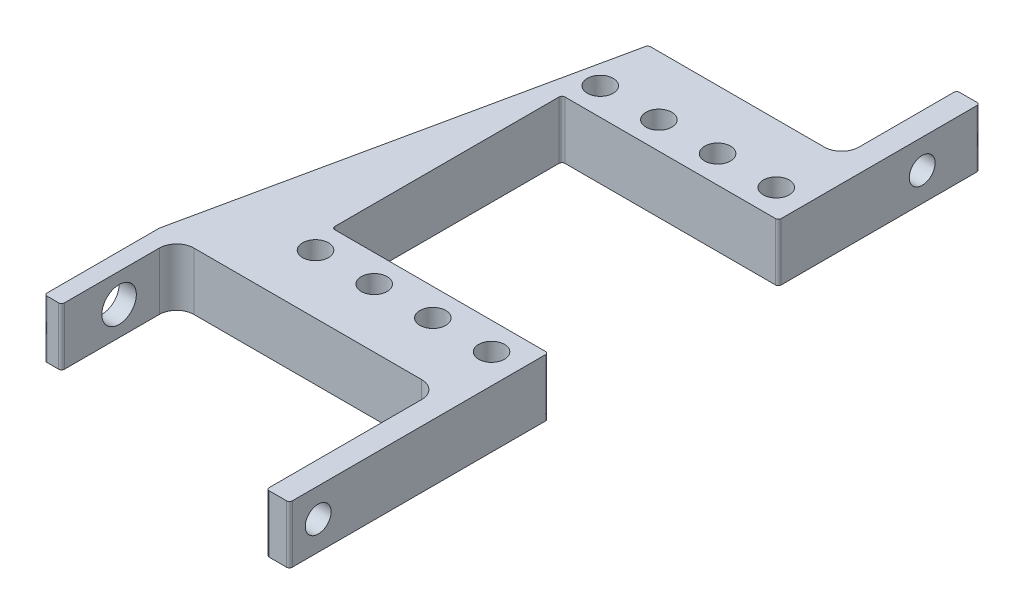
ISO-10303-21;
HEADER;
FILE_DESCRIPTION(('STEP AP214'),'2;1');
FILE_NAME('part.step','',(''),(''),'','','');
FILE_SCHEMA(('AUTOMOTIVE_DESIGN { 1 0 10303 214 1 1 1 1 }'));
ENDSEC;
DATA;
#1=APPLICATION_CONTEXT('core data for automotive mechanical design processes');
#2=APPLICATION_PROTOCOL_DEFINITION('international standard','automotive_design',2000,#1);
#3=PRODUCT_CONTEXT('',#1,'mechanical');
#4=PRODUCT('Part','Part','',(#3));
#5=PRODUCT_RELATED_PRODUCT_CATEGORY('part','',(#4));
#6=PRODUCT_DEFINITION_FORMATION('','',#4);
#7=PRODUCT_DEFINITION_CONTEXT('part definition',#1,'design');
#8=PRODUCT_DEFINITION('design','',#6,#7);
#9=PRODUCT_DEFINITION_SHAPE('','',#8);
#10=(LENGTH_UNIT() NAMED_UNIT(*) SI_UNIT(.MILLI.,.METRE.));
#11=(NAMED_UNIT(*) PLANE_ANGLE_UNIT() SI_UNIT($,.RADIAN.));
#12=(NAMED_UNIT(*) SI_UNIT($,.STERADIAN.) SOLID_ANGLE_UNIT());
#13=UNCERTAINTY_MEASURE_WITH_UNIT(LENGTH_MEASURE(1.E-05),#10,'distance_accuracy_value','');
#14=(GEOMETRIC_REPRESENTATION_CONTEXT(3) GLOBAL_UNCERTAINTY_ASSIGNED_CONTEXT((#13)) GLOBAL_UNIT_ASSIGNED_CONTEXT((#10,
#11,#12)) REPRESENTATION_CONTEXT('',''));
#15=CARTESIAN_POINT('',(0.,0.,0.));
#16=DIRECTION('',(0.,0.,1.));
#17=DIRECTION('',(1.,0.,0.));
#18=AXIS2_PLACEMENT_3D('',#15,#16,#17);
#19=CARTESIAN_POINT('',(0.,0.,10.));
#20=DIRECTION('',(0.,0.,-1.));
#21=DIRECTION('',(-1.,0.,0.));
#22=AXIS2_PLACEMENT_3D('',#19,#20,#21);
#23=PLANE('',#22);
#24=DIRECTION('',(1.,0.,0.));
#25=VECTOR('',#24,1.);
#26=CARTESIAN_POINT('',(52.6143754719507,0.,10.));
#27=LINE('',#26,#25);
#28=CARTESIAN_POINT('',(49.1143754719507,0.,10.));
#29=VERTEX_POINT('',#28);
#30=CARTESIAN_POINT('',(52.1143754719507,0.,10.));
#31=VERTEX_POINT('',#30);
#32=EDGE_CURVE('E603',#29,#31,#27,.T.);
#33=ORIENTED_EDGE('',*,*,#32,.T.);
#34=DIRECTION('',(0.,1.,0.));
#35=VECTOR('',#34,1.);
#36=CARTESIAN_POINT('',(52.1143754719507,0.,10.));
#37=LINE('',#36,#35);
#38=CARTESIAN_POINT('',(52.1143754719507,10.,10.));
#39=VERTEX_POINT('',#38);
#40=EDGE_CURVE('E508',#31,#39,#37,.T.);
#41=ORIENTED_EDGE('',*,*,#40,.T.);
#42=DIRECTION('',(-1.,0.,0.));
#43=VECTOR('',#42,1.);
#44=CARTESIAN_POINT('',(52.6143754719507,10.,10.));
#45=LINE('',#44,#43);
#46=CARTESIAN_POINT('',(49.1143754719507,10.,10.));
#47=VERTEX_POINT('',#46);
#48=EDGE_CURVE('E594',#39,#47,#45,.T.);
#49=ORIENTED_EDGE('',*,*,#48,.T.);
#50=DIRECTION('',(0.,1.,0.));
#51=VECTOR('',#50,1.);
#52=CARTESIAN_POINT('',(49.1143754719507,0.,10.));
#53=LINE('',#52,#51);
#54=EDGE_CURVE('E505',#47,#29,#53,.F.);
#55=ORIENTED_EDGE('',*,*,#54,.T.);
#56=EDGE_LOOP('',(#33,#41,#49,#55));
#57=FACE_BOUND('',#56,.T.);
#58=ADVANCED_FACE('F45',(#57),#23,.F.);
#59=CARTESIAN_POINT('',(60.6143754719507,5.,5.));
#60=DIRECTION('',(-1.,0.,0.));
#61=DIRECTION('',(0.,0.,1.));
#62=AXIS2_PLACEMENT_3D('',#59,#60,#61);
#63=CYLINDRICAL_SURFACE('',#62,2.25);
#64=CARTESIAN_POINT('',(52.6143754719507,5.,5.));
#65=DIRECTION('',(-1.,0.,0.));
#66=DIRECTION('',(0.,0.,1.));
#67=AXIS2_PLACEMENT_3D('',#64,#65,#66);
#68=CIRCLE('',#67,2.25);
#69=CARTESIAN_POINT('',(52.6143754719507,5.,7.25));
#70=VERTEX_POINT('',#69);
#71=EDGE_CURVE('E334',#70,#70,#68,.T.);
#72=ORIENTED_EDGE('',*,*,#71,.F.);
#73=EDGE_LOOP('',(#72));
#74=FACE_BOUND('',#73,.T.);
#75=CARTESIAN_POINT('',(48.6143754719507,5.,5.));
#76=DIRECTION('',(-1.,0.,0.));
#77=DIRECTION('',(0.,0.,1.));
#78=AXIS2_PLACEMENT_3D('',#75,#76,#77);
#79=CIRCLE('',#78,2.25);
#80=CARTESIAN_POINT('',(48.6143754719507,5.,7.25));
#81=VERTEX_POINT('',#80);
#82=EDGE_CURVE('E355',#81,#81,#79,.F.);
#83=ORIENTED_EDGE('',*,*,#82,.F.);
#84=EDGE_LOOP('',(#83));
#85=FACE_BOUND('',#84,.T.);
#86=ADVANCED_FACE('F696',(#74,#85),#63,.F.);
#87=CARTESIAN_POINT('',(0.,0.,-110.002119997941));
#88=DIRECTION('',(0.,0.,-1.));
#89=DIRECTION('',(-1.,0.,0.));
#90=AXIS2_PLACEMENT_3D('',#87,#88,#89);
#91=PLANE('',#90);
#92=DIRECTION('',(-1.,0.,0.));
#93=VECTOR('',#92,1.);
#94=CARTESIAN_POINT('',(52.6143754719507,0.,-110.002119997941));
#95=LINE('',#94,#93);
#96=CARTESIAN_POINT('',(52.1143754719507,0.,-110.002119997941));
#97=VERTEX_POINT('',#96);
#98=CARTESIAN_POINT('',(49.1143754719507,0.,-110.002119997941));
#99=VERTEX_POINT('',#98);
#100=EDGE_CURVE('E584',#97,#99,#95,.T.);
#101=ORIENTED_EDGE('',*,*,#100,.T.);
#102=DIRECTION('',(0.,-1.,0.));
#103=VECTOR('',#102,1.);
#104=CARTESIAN_POINT('',(49.1143754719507,0.,-110.002119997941));
#105=LINE('',#104,#103);
#106=CARTESIAN_POINT('',(49.1143754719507,10.,-110.002119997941));
#107=VERTEX_POINT('',#106);
#108=EDGE_CURVE('E468',#99,#107,#105,.F.);
#109=ORIENTED_EDGE('',*,*,#108,.T.);
#110=DIRECTION('',(1.,0.,0.));
#111=VECTOR('',#110,1.);
#112=CARTESIAN_POINT('',(52.6143754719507,10.,-110.002119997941));
#113=LINE('',#112,#111);
#114=CARTESIAN_POINT('',(52.1143754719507,10.,-110.002119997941));
#115=VERTEX_POINT('',#114);
#116=EDGE_CURVE('E586',#107,#115,#113,.T.);
#117=ORIENTED_EDGE('',*,*,#116,.T.);
#118=DIRECTION('',(0.,-1.,0.));
#119=VECTOR('',#118,1.);
#120=CARTESIAN_POINT('',(52.1143754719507,0.,-110.002119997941));
#121=LINE('',#120,#119);
#122=EDGE_CURVE('E464',#115,#97,#121,.T.);
#123=ORIENTED_EDGE('',*,*,#122,.T.);
#124=EDGE_LOOP('',(#101,#109,#117,#123));
#125=FACE_BOUND('',#124,.T.);
#126=ADVANCED_FACE('F583',(#125),#91,.T.);
#127=CARTESIAN_POINT('',(60.6143754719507,5.,-100.002119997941));
#128=DIRECTION('',(-1.,0.,0.));
#129=DIRECTION('',(0.,0.,1.));
#130=AXIS2_PLACEMENT_3D('',#127,#128,#129);
#131=CYLINDRICAL_SURFACE('',#130,2.25);
#132=CARTESIAN_POINT('',(52.6143754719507,5.,-100.002119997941));
#133=DIRECTION('',(-1.,0.,0.));
#134=DIRECTION('',(0.,0.,1.));
#135=AXIS2_PLACEMENT_3D('',#132,#133,#134);
#136=CIRCLE('',#135,2.25);
#137=CARTESIAN_POINT('',(52.6143754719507,5.,-97.7521199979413));
#138=VERTEX_POINT('',#137);
#139=EDGE_CURVE('E590',#138,#138,#136,.T.);
#140=ORIENTED_EDGE('',*,*,#139,.F.);
#141=EDGE_LOOP('',(#140));
#142=FACE_BOUND('',#141,.T.);
#143=CARTESIAN_POINT('',(48.6143754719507,5.,-100.002119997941));
#144=DIRECTION('',(-1.,0.,0.));
#145=DIRECTION('',(0.,0.,1.));
#146=AXIS2_PLACEMENT_3D('',#143,#144,#145);
#147=CIRCLE('',#146,2.25);
#148=CARTESIAN_POINT('',(48.6143754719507,5.,-97.7521199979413));
#149=VERTEX_POINT('',#148);
#150=EDGE_CURVE('E349',#149,#149,#147,.F.);
#151=ORIENTED_EDGE('',*,*,#150,.F.);
#152=EDGE_LOOP('',(#151));
#153=FACE_BOUND('',#152,.T.);
#154=ADVANCED_FACE('F771',(#142,#153),#131,.F.);
#155=CARTESIAN_POINT('',(0.,10.,0.));
#156=DIRECTION('',(0.,0.,-1.));
#157=DIRECTION('',(-1.,0.,0.));
#158=AXIS2_PLACEMENT_3D('',#155,#156,#157);
#159=PLANE('',#158);
#160=DIRECTION('',(1.,0.,0.));
#161=VECTOR('',#160,1.);
#162=CARTESIAN_POINT('',(0.,10.,0.));
#163=LINE('',#162,#161);
#164=CARTESIAN_POINT('',(0.5,10.,0.));
#165=VERTEX_POINT('',#164);
#166=CARTESIAN_POINT('',(2.5,10.,0.));
#167=VERTEX_POINT('',#166);
#168=EDGE_CURVE('E308',#165,#167,#163,.T.);
#169=ORIENTED_EDGE('',*,*,#168,.F.);
#170=DIRECTION('',(0.,-1.,0.));
#171=VECTOR('',#170,1.);
#172=CARTESIAN_POINT('',(0.5,0.,0.));
#173=LINE('',#172,#171);
#174=CARTESIAN_POINT('',(0.5,0.,0.));
#175=VERTEX_POINT('',#174);
#176=EDGE_CURVE('E518',#165,#175,#173,.T.);
#177=ORIENTED_EDGE('',*,*,#176,.T.);
#178=DIRECTION('',(1.,0.,0.));
#179=VECTOR('',#178,1.);
#180=CARTESIAN_POINT('',(0.,0.,0.));
#181=LINE('',#180,#179);
#182=CARTESIAN_POINT('',(2.5,0.,0.));
#183=VERTEX_POINT('',#182);
#184=EDGE_CURVE('E272',#175,#183,#181,.T.);
#185=ORIENTED_EDGE('',*,*,#184,.T.);
#186=DIRECTION('',(0.,-1.,0.));
#187=VECTOR('',#186,1.);
#188=CARTESIAN_POINT('',(2.5,10.,0.));
#189=LINE('',#188,#187);
#190=EDGE_CURVE('E61',#183,#167,#189,.F.);
#191=ORIENTED_EDGE('',*,*,#190,.T.);
#192=EDGE_LOOP('',(#169,#177,#185,#191));
#193=FACE_BOUND('',#192,.T.);
#194=ADVANCED_FACE('F749',(#193),#159,.F.);
#195=CARTESIAN_POINT('',(52.6143754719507,10.,-90.0021199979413));
#196=DIRECTION('',(0.,0.,1.));
#197=DIRECTION('',(1.,0.,0.));
#198=AXIS2_PLACEMENT_3D('',#195,#196,#197);
#199=PLANE('',#198);
#200=DIRECTION('',(-1.,0.,0.));
#201=VECTOR('',#200,1.);
#202=CARTESIAN_POINT('',(52.6143754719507,0.,-90.0021199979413));
#203=LINE('',#202,#201);
#204=CARTESIAN_POINT('',(45.6143754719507,0.,-90.0021199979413));
#205=VERTEX_POINT('',#204);
#206=CARTESIAN_POINT('',(15.3986176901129,0.,-90.0021199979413));
#207=VERTEX_POINT('',#206);
#208=EDGE_CURVE('E300',#205,#207,#203,.T.);
#209=ORIENTED_EDGE('',*,*,#208,.T.);
#210=DIRECTION('',(0.,-1.,0.));
#211=VECTOR('',#210,1.);
#212=CARTESIAN_POINT('',(15.3986176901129,10.,-90.0021199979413));
#213=LINE('',#212,#211);
#214=CARTESIAN_POINT('',(15.3986176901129,10.,-90.0021199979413));
#215=VERTEX_POINT('',#214);
#216=EDGE_CURVE('E432',#207,#215,#213,.F.);
#217=ORIENTED_EDGE('',*,*,#216,.T.);
#218=DIRECTION('',(-1.,0.,0.));
#219=VECTOR('',#218,1.);
#220=CARTESIAN_POINT('',(52.6143754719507,10.,-90.0021199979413));
#221=LINE('',#220,#219);
#222=CARTESIAN_POINT('',(45.6143754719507,10.,-90.0021199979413));
#223=VERTEX_POINT('',#222);
#224=EDGE_CURVE('E265',#223,#215,#221,.T.);
#225=ORIENTED_EDGE('',*,*,#224,.F.);
#226=DIRECTION('',(0.,1.,0.));
#227=VECTOR('',#226,1.);
#228=CARTESIAN_POINT('',(45.6143754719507,10.,-90.0021199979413));
#229=LINE('',#228,#227);
#230=EDGE_CURVE('E378',#223,#205,#229,.F.);
#231=ORIENTED_EDGE('',*,*,#230,.T.);
#232=EDGE_LOOP('',(#209,#217,#225,#231));
#233=FACE_BOUND('',#232,.T.);
#234=ADVANCED_FACE('F745',(#233),#199,.F.);
#235=CARTESIAN_POINT('',(15.,10.,-20.));
#236=DIRECTION('',(0.,0.,-1.));
#237=DIRECTION('',(-1.,0.,0.));
#238=AXIS2_PLACEMENT_3D('',#235,#236,#237);
#239=PLANE('',#238);
#240=DIRECTION('',(1.,0.,0.));
#241=VECTOR('',#240,1.);
#242=CARTESIAN_POINT('',(15.,0.,-20.));
#243=LINE('',#242,#241);
#244=CARTESIAN_POINT('',(6.,0.,-20.));
#245=VERTEX_POINT('',#244);
#246=CARTESIAN_POINT('',(45.6143754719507,0.,-20.));
#247=VERTEX_POINT('',#246);
#248=EDGE_CURVE('E275',#245,#247,#243,.T.);
#249=ORIENTED_EDGE('',*,*,#248,.T.);
#250=DIRECTION('',(0.,-1.,0.));
#251=VECTOR('',#250,1.);
#252=CARTESIAN_POINT('',(45.6143754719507,10.,-20.));
#253=LINE('',#252,#251);
#254=CARTESIAN_POINT('',(45.6143754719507,10.,-20.));
#255=VERTEX_POINT('',#254);
#256=EDGE_CURVE('E367',#247,#255,#253,.F.);
#257=ORIENTED_EDGE('',*,*,#256,.T.);
#258=DIRECTION('',(1.,0.,0.));
#259=VECTOR('',#258,1.);
#260=CARTESIAN_POINT('',(15.,10.,-20.));
#261=LINE('',#260,#259);
#262=CARTESIAN_POINT('',(6.,10.,-20.));
#263=VERTEX_POINT('',#262);
#264=EDGE_CURVE('E620',#263,#255,#261,.T.);
#265=ORIENTED_EDGE('',*,*,#264,.F.);
#266=DIRECTION('',(0.,1.,0.));
#267=VECTOR('',#266,1.);
#268=CARTESIAN_POINT('',(6.,10.,-20.));
#269=LINE('',#268,#267);
#270=EDGE_CURVE('E364',#263,#245,#269,.F.);
#271=ORIENTED_EDGE('',*,*,#270,.T.);
#272=EDGE_LOOP('',(#249,#257,#265,#271));
#273=FACE_BOUND('',#272,.T.);
#274=ADVANCED_FACE('F748',(#273),#239,.F.);
#275=CARTESIAN_POINT('',(47.5,-16.,-30.25));
#276=DIRECTION('',(0.,1.,0.));
#277=DIRECTION('',(0.,0.,1.));
#278=AXIS2_PLACEMENT_3D('',#275,#276,#277);
#279=CYLINDRICAL_SURFACE('',#278,2.25);
#280=CARTESIAN_POINT('',(47.5,10.,-30.25));
#281=DIRECTION('',(0.,1.,0.));
#282=DIRECTION('',(0.,0.,1.));
#283=AXIS2_PLACEMENT_3D('',#280,#281,#282);
#284=CIRCLE('',#283,2.25);
#285=CARTESIAN_POINT('',(47.5,10.,-28.));
#286=VERTEX_POINT('',#285);
#287=EDGE_CURVE('E321',#286,#286,#284,.T.);
#288=ORIENTED_EDGE('',*,*,#287,.T.);
#289=EDGE_LOOP('',(#288));
#290=FACE_BOUND('',#289,.T.);
#291=CARTESIAN_POINT('',(47.5,0.,-30.25));
#292=DIRECTION('',(0.,1.,0.));
#293=DIRECTION('',(0.,0.,1.));
#294=AXIS2_PLACEMENT_3D('',#291,#292,#293);
#295=CIRCLE('',#294,2.25);
#296=CARTESIAN_POINT('',(47.5,0.,-28.));
#297=VERTEX_POINT('',#296);
#298=EDGE_CURVE('E325',#297,#297,#295,.T.);
#299=ORIENTED_EDGE('',*,*,#298,.F.);
#300=EDGE_LOOP('',(#299));
#301=FACE_BOUND('',#300,.T.);
#302=ADVANCED_FACE('F767',(#290,#301),#279,.F.);
#303=CARTESIAN_POINT('',(37.3,-16.,-30.25));
#304=DIRECTION('',(0.,1.,0.));
#305=DIRECTION('',(0.,0.,1.));
#306=AXIS2_PLACEMENT_3D('',#303,#304,#305);
#307=CYLINDRICAL_SURFACE('',#306,2.25);
#308=CARTESIAN_POINT('',(37.3,10.,-30.25));
#309=DIRECTION('',(0.,1.,0.));
#310=DIRECTION('',(0.,0.,1.));
#311=AXIS2_PLACEMENT_3D('',#308,#309,#310);
#312=CIRCLE('',#311,2.25);
#313=CARTESIAN_POINT('',(37.3,10.,-28.));
#314=VERTEX_POINT('',#313);
#315=EDGE_CURVE('E257',#314,#314,#312,.T.);
#316=ORIENTED_EDGE('',*,*,#315,.T.);
#317=EDGE_LOOP('',(#316));
#318=FACE_BOUND('',#317,.T.);
#319=CARTESIAN_POINT('',(37.3,0.,-30.25));
#320=DIRECTION('',(0.,1.,0.));
#321=DIRECTION('',(0.,0.,1.));
#322=AXIS2_PLACEMENT_3D('',#319,#320,#321);
#323=CIRCLE('',#322,2.25);
#324=CARTESIAN_POINT('',(37.3,0.,-28.));
#325=VERTEX_POINT('',#324);
#326=EDGE_CURVE('E317',#325,#325,#323,.T.);
#327=ORIENTED_EDGE('',*,*,#326,.F.);
#328=EDGE_LOOP('',(#327));
#329=FACE_BOUND('',#328,.T.);
#330=ADVANCED_FACE('F764',(#318,#329),#307,.F.);
#331=CARTESIAN_POINT('',(52.6143754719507,10.,-20.));
#332=DIRECTION('',(-1.,0.,0.));
#333=DIRECTION('',(0.,0.,1.));
#334=AXIS2_PLACEMENT_3D('',#331,#332,#333);
#335=PLANE('',#334);
#336=ORIENTED_EDGE('',*,*,#71,.T.);
#337=EDGE_LOOP('',(#336));
#338=FACE_BOUND('',#337,.T.);
#339=DIRECTION('',(0.,0.,-1.));
#340=VECTOR('',#339,1.);
#341=CARTESIAN_POINT('',(52.6143754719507,0.,-20.));
#342=LINE('',#341,#340);
#343=CARTESIAN_POINT('',(52.6143754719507,0.,9.5));
#344=VERTEX_POINT('',#343);
#345=CARTESIAN_POINT('',(52.6143754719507,0.,-34.5));
#346=VERTEX_POINT('',#345);
#347=EDGE_CURVE('E280',#344,#346,#342,.T.);
#348=ORIENTED_EDGE('',*,*,#347,.T.);
#349=DIRECTION('',(0.,-1.,0.));
#350=VECTOR('',#349,1.);
#351=CARTESIAN_POINT('',(52.6143754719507,10.,-34.5));
#352=LINE('',#351,#350);
#353=CARTESIAN_POINT('',(52.6143754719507,10.,-34.5));
#354=VERTEX_POINT('',#353);
#355=EDGE_CURVE('E502',#346,#354,#352,.F.);
#356=ORIENTED_EDGE('',*,*,#355,.T.);
#357=DIRECTION('',(0.,0.,-1.));
#358=VECTOR('',#357,1.);
#359=CARTESIAN_POINT('',(52.6143754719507,10.,-20.));
#360=LINE('',#359,#358);
#361=CARTESIAN_POINT('',(52.6143754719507,10.,9.5));
#362=VERTEX_POINT('',#361);
#363=EDGE_CURVE('E564',#362,#354,#360,.T.);
#364=ORIENTED_EDGE('',*,*,#363,.F.);
#365=DIRECTION('',(0.,1.,0.));
#366=VECTOR('',#365,1.);
#367=CARTESIAN_POINT('',(52.6143754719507,10.,9.5));
#368=LINE('',#367,#366);
#369=EDGE_CURVE('E499',#362,#344,#368,.F.);
#370=ORIENTED_EDGE('',*,*,#369,.T.);
#371=EDGE_LOOP('',(#348,#356,#364,#370));
#372=FACE_BOUND('',#371,.T.);
#373=ADVANCED_FACE('F635',(#338,#372),#335,.F.);
#374=CARTESIAN_POINT('',(15.,10.,-35.));
#375=DIRECTION('',(0.,0.,-1.));
#376=DIRECTION('',(-1.,0.,0.));
#377=AXIS2_PLACEMENT_3D('',#374,#375,#376);
#378=PLANE('',#377);
#379=DIRECTION('',(1.,0.,0.));
#380=VECTOR('',#379,1.);
#381=CARTESIAN_POINT('',(15.,0.,-35.));
#382=LINE('',#381,#380);
#383=CARTESIAN_POINT('',(15.5,0.,-35.));
#384=VERTEX_POINT('',#383);
#385=CARTESIAN_POINT('',(52.1143754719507,0.,-35.));
#386=VERTEX_POINT('',#385);
#387=EDGE_CURVE('E284',#384,#386,#382,.T.);
#388=ORIENTED_EDGE('',*,*,#387,.F.);
#389=DIRECTION('',(0.,-1.,0.));
#390=VECTOR('',#389,1.);
#391=CARTESIAN_POINT('',(15.5,10.,-35.));
#392=LINE('',#391,#390);
#393=CARTESIAN_POINT('',(15.5,10.,-35.));
#394=VERTEX_POINT('',#393);
#395=EDGE_CURVE('E496',#384,#394,#392,.F.);
#396=ORIENTED_EDGE('',*,*,#395,.T.);
#397=DIRECTION('',(1.,0.,0.));
#398=VECTOR('',#397,1.);
#399=CARTESIAN_POINT('',(15.,10.,-35.));
#400=LINE('',#399,#398);
#401=CARTESIAN_POINT('',(52.1143754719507,10.,-35.));
#402=VERTEX_POINT('',#401);
#403=EDGE_CURVE('E553',#394,#402,#400,.T.);
#404=ORIENTED_EDGE('',*,*,#403,.T.);
#405=DIRECTION('',(0.,-1.,0.));
#406=VECTOR('',#405,1.);
#407=CARTESIAN_POINT('',(52.1143754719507,0.,-35.));
#408=LINE('',#407,#406);
#409=EDGE_CURVE('E492',#402,#386,#408,.T.);
#410=ORIENTED_EDGE('',*,*,#409,.T.);
#411=EDGE_LOOP('',(#388,#396,#404,#410));
#412=FACE_BOUND('',#411,.T.);
#413=ADVANCED_FACE('F543',(#412),#378,.T.);
#414=CARTESIAN_POINT('',(15.,10.,-35.));
#415=DIRECTION('',(-1.,0.,0.));
#416=DIRECTION('',(0.,0.,1.));
#417=AXIS2_PLACEMENT_3D('',#414,#415,#416);
#418=PLANE('',#417);
#419=DIRECTION('',(0.,0.,-1.));
#420=VECTOR('',#419,1.);
#421=CARTESIAN_POINT('',(15.,0.,-35.));
#422=LINE('',#421,#420);
#423=CARTESIAN_POINT('',(15.,0.,-35.5));
#424=VERTEX_POINT('',#423);
#425=CARTESIAN_POINT('',(15.,0.,-74.5));
#426=VERTEX_POINT('',#425);
#427=EDGE_CURVE('E288',#424,#426,#422,.T.);
#428=ORIENTED_EDGE('',*,*,#427,.T.);
#429=DIRECTION('',(0.,-1.,0.));
#430=VECTOR('',#429,1.);
#431=CARTESIAN_POINT('',(15.,10.,-74.5));
#432=LINE('',#431,#430);
#433=CARTESIAN_POINT('',(15.,10.,-74.5));
#434=VERTEX_POINT('',#433);
#435=EDGE_CURVE('E489',#426,#434,#432,.F.);
#436=ORIENTED_EDGE('',*,*,#435,.T.);
#437=DIRECTION('',(0.,0.,-1.));
#438=VECTOR('',#437,1.);
#439=CARTESIAN_POINT('',(15.,10.,-35.));
#440=LINE('',#439,#438);
#441=CARTESIAN_POINT('',(15.,10.,-35.5));
#442=VERTEX_POINT('',#441);
#443=EDGE_CURVE('E551',#442,#434,#440,.T.);
#444=ORIENTED_EDGE('',*,*,#443,.F.);
#445=DIRECTION('',(0.,-1.,0.));
#446=VECTOR('',#445,1.);
#447=CARTESIAN_POINT('',(15.,10.,-35.5));
#448=LINE('',#447,#446);
#449=EDGE_CURVE('E485',#442,#424,#448,.T.);
#450=ORIENTED_EDGE('',*,*,#449,.T.);
#451=EDGE_LOOP('',(#428,#436,#444,#450));
#452=FACE_BOUND('',#451,.T.);
#453=ADVANCED_FACE('F555',(#452),#418,.F.);
#454=CARTESIAN_POINT('',(15.,10.,-75.));
#455=DIRECTION('',(0.,0.,-1.));
#456=DIRECTION('',(-1.,0.,0.));
#457=AXIS2_PLACEMENT_3D('',#454,#455,#456);
#458=PLANE('',#457);
#459=DIRECTION('',(1.,0.,0.));
#460=VECTOR('',#459,1.);
#461=CARTESIAN_POINT('',(15.,0.,-75.));
#462=LINE('',#461,#460);
#463=CARTESIAN_POINT('',(15.5,0.,-75.));
#464=VERTEX_POINT('',#463);
#465=CARTESIAN_POINT('',(52.1143754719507,0.,-75.));
#466=VERTEX_POINT('',#465);
#467=EDGE_CURVE('E292',#464,#466,#462,.T.);
#468=ORIENTED_EDGE('',*,*,#467,.T.);
#469=DIRECTION('',(0.,-1.,0.));
#470=VECTOR('',#469,1.);
#471=CARTESIAN_POINT('',(52.1143754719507,10.,-75.));
#472=LINE('',#471,#470);
#473=CARTESIAN_POINT('',(52.1143754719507,10.,-75.));
#474=VERTEX_POINT('',#473);
#475=EDGE_CURVE('E482',#466,#474,#472,.F.);
#476=ORIENTED_EDGE('',*,*,#475,.T.);
#477=DIRECTION('',(1.,0.,0.));
#478=VECTOR('',#477,1.);
#479=CARTESIAN_POINT('',(15.,10.,-75.));
#480=LINE('',#479,#478);
#481=CARTESIAN_POINT('',(15.5,10.,-75.));
#482=VERTEX_POINT('',#481);
#483=EDGE_CURVE('E558',#482,#474,#480,.T.);
#484=ORIENTED_EDGE('',*,*,#483,.F.);
#485=DIRECTION('',(0.,-1.,0.));
#486=VECTOR('',#485,1.);
#487=CARTESIAN_POINT('',(15.5,0.,-75.));
#488=LINE('',#487,#486);
#489=EDGE_CURVE('E478',#482,#464,#488,.T.);
#490=ORIENTED_EDGE('',*,*,#489,.T.);
#491=EDGE_LOOP('',(#468,#476,#484,#490));
#492=FACE_BOUND('',#491,.T.);
#493=ADVANCED_FACE('F753',(#492),#458,.F.);
#494=CARTESIAN_POINT('',(52.6143754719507,10.,-75.));
#495=DIRECTION('',(-1.,0.,0.));
#496=DIRECTION('',(0.,0.,1.));
#497=AXIS2_PLACEMENT_3D('',#494,#495,#496);
#498=PLANE('',#497);
#499=ORIENTED_EDGE('',*,*,#139,.T.);
#500=EDGE_LOOP('',(#499));
#501=FACE_BOUND('',#500,.T.);
#502=DIRECTION('',(0.,0.,-1.));
#503=VECTOR('',#502,1.);
#504=CARTESIAN_POINT('',(52.6143754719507,0.,-75.));
#505=LINE('',#504,#503);
#506=CARTESIAN_POINT('',(52.6143754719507,0.,-75.5));
#507=VERTEX_POINT('',#506);
#508=CARTESIAN_POINT('',(52.6143754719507,0.,-109.502119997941));
#509=VERTEX_POINT('',#508);
#510=EDGE_CURVE('E296',#507,#509,#505,.T.);
#511=ORIENTED_EDGE('',*,*,#510,.T.);
#512=DIRECTION('',(0.,-1.,0.));
#513=VECTOR('',#512,1.);
#514=CARTESIAN_POINT('',(52.6143754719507,10.,-109.502119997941));
#515=LINE('',#514,#513);
#516=CARTESIAN_POINT('',(52.6143754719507,10.,-109.502119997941));
#517=VERTEX_POINT('',#516);
#518=EDGE_CURVE('E475',#509,#517,#515,.F.);
#519=ORIENTED_EDGE('',*,*,#518,.T.);
#520=DIRECTION('',(0.,0.,-1.));
#521=VECTOR('',#520,1.);
#522=CARTESIAN_POINT('',(52.6143754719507,10.,-75.));
#523=LINE('',#522,#521);
#524=CARTESIAN_POINT('',(52.6143754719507,10.,-75.5));
#525=VERTEX_POINT('',#524);
#526=EDGE_CURVE('E268',#525,#517,#523,.T.);
#527=ORIENTED_EDGE('',*,*,#526,.F.);
#528=DIRECTION('',(0.,-1.,0.));
#529=VECTOR('',#528,1.);
#530=CARTESIAN_POINT('',(52.6143754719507,10.,-75.5));
#531=LINE('',#530,#529);
#532=EDGE_CURVE('E471',#525,#507,#531,.T.);
#533=ORIENTED_EDGE('',*,*,#532,.T.);
#534=EDGE_LOOP('',(#511,#519,#527,#533));
#535=FACE_BOUND('',#534,.T.);
#536=ADVANCED_FACE('F744',(#501,#535),#498,.F.);
#537=CARTESIAN_POINT('',(0.,10.,-20.));
#538=DIRECTION('',(-0.97781980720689,0.,-0.209447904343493));
#539=DIRECTION('',(-0.209447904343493,0.,0.97781980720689));
#540=AXIS2_PLACEMENT_3D('',#537,#538,#539);
#541=PLANE('',#540);
#542=DIRECTION('',(0.209447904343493,0.,-0.97781980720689));
#543=VECTOR('',#542,1.);
#544=CARTESIAN_POINT('',(0.,10.,-20.));
#545=LINE('',#544,#543);
#546=CARTESIAN_POINT('',(0.,10.,-20.));
#547=VERTEX_POINT('',#546);
#548=CARTESIAN_POINT('',(14.9097077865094,10.,-89.606843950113));
#549=VERTEX_POINT('',#548);
#550=EDGE_CURVE('E247',#547,#549,#545,.T.);
#551=ORIENTED_EDGE('',*,*,#550,.T.);
#552=DIRECTION('',(0.,-1.,0.));
#553=VECTOR('',#552,1.);
#554=CARTESIAN_POINT('',(14.9097077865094,0.,-89.606843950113));
#555=LINE('',#554,#553);
#556=CARTESIAN_POINT('',(14.9097077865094,0.,-89.606843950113));
#557=VERTEX_POINT('',#556);
#558=EDGE_CURVE('E402',#549,#557,#555,.T.);
#559=ORIENTED_EDGE('',*,*,#558,.T.);
#560=DIRECTION('',(0.209447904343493,0.,-0.97781980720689));
#561=VECTOR('',#560,1.);
#562=CARTESIAN_POINT('',(0.,0.,-20.));
#563=LINE('',#562,#561);
#564=CARTESIAN_POINT('',(0.,0.,-20.));
#565=VERTEX_POINT('',#564);
#566=EDGE_CURVE('E255',#565,#557,#563,.T.);
#567=ORIENTED_EDGE('',*,*,#566,.F.);
#568=DIRECTION('',(0.,-1.,0.));
#569=VECTOR('',#568,1.);
#570=CARTESIAN_POINT('',(0.,10.,-20.));
#571=LINE('',#570,#569);
#572=EDGE_CURVE('E241',#547,#565,#571,.T.);
#573=ORIENTED_EDGE('',*,*,#572,.F.);
#574=EDGE_LOOP('',(#551,#559,#567,#573));
#575=FACE_BOUND('',#574,.T.);
#576=ADVANCED_FACE('F251',(#575),#541,.T.);
#577=CARTESIAN_POINT('',(0.,10.,0.));
#578=DIRECTION('',(-1.,0.,0.));
#579=DIRECTION('',(0.,0.,1.));
#580=AXIS2_PLACEMENT_3D('',#577,#578,#579);
#581=PLANE('',#580);
#582=CARTESIAN_POINT('',(0.,5.,-10.));
#583=DIRECTION('',(-1.,0.,0.));
#584=DIRECTION('',(0.,0.,1.));
#585=AXIS2_PLACEMENT_3D('',#582,#583,#584);
#586=CIRCLE('',#585,3.);
#587=CARTESIAN_POINT('',(0.,5.,-7.));
#588=VERTEX_POINT('',#587);
#589=EDGE_CURVE('E667',#588,#588,#586,.T.);
#590=ORIENTED_EDGE('',*,*,#589,.F.);
#591=EDGE_LOOP('',(#590));
#592=FACE_BOUND('',#591,.T.);
#593=DIRECTION('',(0.,0.,-1.));
#594=VECTOR('',#593,1.);
#595=CARTESIAN_POINT('',(0.,0.,0.));
#596=LINE('',#595,#594);
#597=CARTESIAN_POINT('',(0.,0.,-0.5));
#598=VERTEX_POINT('',#597);
#599=EDGE_CURVE('E306',#598,#565,#596,.T.);
#600=ORIENTED_EDGE('',*,*,#599,.F.);
#601=DIRECTION('',(0.,-1.,0.));
#602=VECTOR('',#601,1.);
#603=CARTESIAN_POINT('',(0.,10.,-0.5));
#604=LINE('',#603,#602);
#605=CARTESIAN_POINT('',(0.,10.,-0.5));
#606=VERTEX_POINT('',#605);
#607=EDGE_CURVE('E244',#598,#606,#604,.F.);
#608=ORIENTED_EDGE('',*,*,#607,.T.);
#609=DIRECTION('',(0.,0.,-1.));
#610=VECTOR('',#609,1.);
#611=CARTESIAN_POINT('',(0.,10.,0.));
#612=LINE('',#611,#610);
#613=EDGE_CURVE('E237',#606,#547,#612,.T.);
#614=ORIENTED_EDGE('',*,*,#613,.T.);
#615=ORIENTED_EDGE('',*,*,#572,.T.);
#616=EDGE_LOOP('',(#600,#608,#614,#615));
#617=FACE_BOUND('',#616,.T.);
#618=ADVANCED_FACE('F240',(#592,#617),#581,.T.);
#619=CARTESIAN_POINT('',(0.,10.,0.));
#620=DIRECTION('',(0.,1.,0.));
#621=DIRECTION('',(0.,0.,1.));
#622=AXIS2_PLACEMENT_3D('',#619,#620,#621);
#623=PLANE('',#622);
#624=ORIENTED_EDGE('',*,*,#224,.T.);
#625=CARTESIAN_POINT('',(15.3986176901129,10.,-89.5021199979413));
#626=DIRECTION('',(0.,1.,0.));
#627=DIRECTION('',(0.,0.,1.));
#628=AXIS2_PLACEMENT_3D('',#625,#626,#627);
#629=CIRCLE('',#628,0.5);
#630=EDGE_CURVE('E263',#215,#549,#629,.T.);
#631=ORIENTED_EDGE('',*,*,#630,.T.);
#632=ORIENTED_EDGE('',*,*,#550,.F.);
#633=ORIENTED_EDGE('',*,*,#613,.F.);
#634=CARTESIAN_POINT('',(0.5,10.,-0.5));
#635=DIRECTION('',(0.,1.,0.));
#636=DIRECTION('',(0.,0.,1.));
#637=AXIS2_PLACEMENT_3D('',#634,#635,#636);
#638=CIRCLE('',#637,0.5);
#639=EDGE_CURVE('E68',#606,#165,#638,.T.);
#640=ORIENTED_EDGE('',*,*,#639,.T.);
#641=ORIENTED_EDGE('',*,*,#168,.T.);
#642=CARTESIAN_POINT('',(2.5,10.,-0.5));
#643=DIRECTION('',(0.,1.,0.));
#644=DIRECTION('',(0.,0.,1.));
#645=AXIS2_PLACEMENT_3D('',#642,#643,#644);
#646=CIRCLE('',#645,0.5);
#647=CARTESIAN_POINT('',(3.,10.,-0.5));
#648=VERTEX_POINT('',#647);
#649=EDGE_CURVE('E435',#167,#648,#646,.T.);
#650=ORIENTED_EDGE('',*,*,#649,.T.);
#651=DIRECTION('',(0.,0.,1.));
#652=VECTOR('',#651,1.);
#653=CARTESIAN_POINT('',(3.,10.,-20.));
#654=LINE('',#653,#652);
#655=CARTESIAN_POINT('',(3.,10.,-17.));
#656=VERTEX_POINT('',#655);
#657=EDGE_CURVE('E674',#656,#648,#654,.T.);
#658=ORIENTED_EDGE('',*,*,#657,.F.);
#659=CARTESIAN_POINT('',(6.,10.,-17.));
#660=DIRECTION('',(0.,1.,0.));
#661=DIRECTION('',(0.,0.,1.));
#662=AXIS2_PLACEMENT_3D('',#659,#660,#661);
#663=CIRCLE('',#662,3.);
#664=EDGE_CURVE('E388',#656,#263,#663,.F.);
#665=ORIENTED_EDGE('',*,*,#664,.T.);
#666=ORIENTED_EDGE('',*,*,#264,.T.);
#667=CARTESIAN_POINT('',(45.6143754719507,10.,-17.));
#668=DIRECTION('',(0.,1.,0.));
#669=DIRECTION('',(0.,0.,1.));
#670=AXIS2_PLACEMENT_3D('',#667,#668,#669);
#671=CIRCLE('',#670,3.);
#672=CARTESIAN_POINT('',(48.6143754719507,10.,-17.));
#673=VERTEX_POINT('',#672);
#674=EDGE_CURVE('E384',#255,#673,#671,.F.);
#675=ORIENTED_EDGE('',*,*,#674,.T.);
#676=DIRECTION('',(0.,0.,-1.));
#677=VECTOR('',#676,1.);
#678=CARTESIAN_POINT('',(48.6143754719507,10.,10.));
#679=LINE('',#678,#677);
#680=CARTESIAN_POINT('',(48.6143754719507,10.,9.5));
#681=VERTEX_POINT('',#680);
#682=EDGE_CURVE('E654',#681,#673,#679,.T.);
#683=ORIENTED_EDGE('',*,*,#682,.F.);
#684=CARTESIAN_POINT('',(49.1143754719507,10.,9.5));
#685=DIRECTION('',(0.,1.,0.));
#686=DIRECTION('',(0.,0.,1.));
#687=AXIS2_PLACEMENT_3D('',#684,#685,#686);
#688=CIRCLE('',#687,0.5);
#689=EDGE_CURVE('E440',#681,#47,#688,.T.);
#690=ORIENTED_EDGE('',*,*,#689,.T.);
#691=ORIENTED_EDGE('',*,*,#48,.F.);
#692=CARTESIAN_POINT('',(52.1143754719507,10.,9.5));
#693=DIRECTION('',(0.,1.,0.));
#694=DIRECTION('',(0.,0.,1.));
#695=AXIS2_PLACEMENT_3D('',#692,#693,#694);
#696=CIRCLE('',#695,0.5);
#697=EDGE_CURVE('E443',#39,#362,#696,.T.);
#698=ORIENTED_EDGE('',*,*,#697,.T.);
#699=ORIENTED_EDGE('',*,*,#363,.T.);
#700=CARTESIAN_POINT('',(52.1143754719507,10.,-34.5));
#701=DIRECTION('',(0.,1.,0.));
#702=DIRECTION('',(0.,0.,1.));
#703=AXIS2_PLACEMENT_3D('',#700,#701,#702);
#704=CIRCLE('',#703,0.5);
#705=EDGE_CURVE('E446',#354,#402,#704,.T.);
#706=ORIENTED_EDGE('',*,*,#705,.T.);
#707=ORIENTED_EDGE('',*,*,#403,.F.);
#708=CARTESIAN_POINT('',(15.5,10.,-35.5));
#709=DIRECTION('',(0.,1.,0.));
#710=DIRECTION('',(0.,0.,1.));
#711=AXIS2_PLACEMENT_3D('',#708,#709,#710);
#712=CIRCLE('',#711,0.5);
#713=EDGE_CURVE('E11',#394,#442,#712,.F.);
#714=ORIENTED_EDGE('',*,*,#713,.T.);
#715=ORIENTED_EDGE('',*,*,#443,.T.);
#716=CARTESIAN_POINT('',(15.5,10.,-74.5));
#717=DIRECTION('',(0.,1.,0.));
#718=DIRECTION('',(0.,0.,1.));
#719=AXIS2_PLACEMENT_3D('',#716,#717,#718);
#720=CIRCLE('',#719,0.5);
#721=EDGE_CURVE('E531',#434,#482,#720,.F.);
#722=ORIENTED_EDGE('',*,*,#721,.T.);
#723=ORIENTED_EDGE('',*,*,#483,.T.);
#724=CARTESIAN_POINT('',(52.1143754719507,10.,-75.5));
#725=DIRECTION('',(0.,1.,0.));
#726=DIRECTION('',(0.,0.,1.));
#727=AXIS2_PLACEMENT_3D('',#724,#725,#726);
#728=CIRCLE('',#727,0.5);
#729=EDGE_CURVE('E449',#474,#525,#728,.T.);
#730=ORIENTED_EDGE('',*,*,#729,.T.);
#731=ORIENTED_EDGE('',*,*,#526,.T.);
#732=CARTESIAN_POINT('',(52.1143754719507,10.,-109.502119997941));
#733=DIRECTION('',(0.,1.,0.));
#734=DIRECTION('',(0.,0.,1.));
#735=AXIS2_PLACEMENT_3D('',#732,#733,#734);
#736=CIRCLE('',#735,0.5);
#737=EDGE_CURVE('E452',#517,#115,#736,.T.);
#738=ORIENTED_EDGE('',*,*,#737,.T.);
#739=ORIENTED_EDGE('',*,*,#116,.F.);
#740=CARTESIAN_POINT('',(49.1143754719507,10.,-109.502119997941));
#741=DIRECTION('',(0.,1.,0.));
#742=DIRECTION('',(0.,0.,1.));
#743=AXIS2_PLACEMENT_3D('',#740,#741,#742);
#744=CIRCLE('',#743,0.5);
#745=CARTESIAN_POINT('',(48.6143754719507,10.,-109.502119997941));
#746=VERTEX_POINT('',#745);
#747=EDGE_CURVE('E455',#107,#746,#744,.T.);
#748=ORIENTED_EDGE('',*,*,#747,.T.);
#749=DIRECTION('',(0.,0.,-1.));
#750=VECTOR('',#749,1.);
#751=CARTESIAN_POINT('',(48.6143754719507,10.,-90.0021199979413));
#752=LINE('',#751,#750);
#753=CARTESIAN_POINT('',(48.6143754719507,10.,-93.0021199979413));
#754=VERTEX_POINT('',#753);
#755=EDGE_CURVE('E354',#754,#746,#752,.T.);
#756=ORIENTED_EDGE('',*,*,#755,.F.);
#757=CARTESIAN_POINT('',(45.6143754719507,10.,-93.0021199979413));
#758=DIRECTION('',(0.,1.,0.));
#759=DIRECTION('',(0.,0.,1.));
#760=AXIS2_PLACEMENT_3D('',#757,#758,#759);
#761=CIRCLE('',#760,3.);
#762=EDGE_CURVE('E395',#754,#223,#761,.F.);
#763=ORIENTED_EDGE('',*,*,#762,.T.);
#764=EDGE_LOOP('',(#624,#631,#632,#633,#640,#641,#650,#658,#665,#666,#675,#683,#690,#691,#698,
#699,#706,#707,#714,#715,#722,#723,#730,#731,#738,#739,#748,#756,#763));
#765=FACE_BOUND('',#764,.T.);
#766=CARTESIAN_POINT('',(27.1,10.,-79.75));
#767=DIRECTION('',(0.,-1.,0.));
#768=DIRECTION('',(0.,0.,-1.));
#769=AXIS2_PLACEMENT_3D('',#766,#767,#768);
#770=CIRCLE('',#769,2.25);
#771=CARTESIAN_POINT('',(27.1,10.,-82.));
#772=VERTEX_POINT('',#771);
#773=EDGE_CURVE('E341',#772,#772,#770,.T.);
#774=ORIENTED_EDGE('',*,*,#773,.T.);
#775=EDGE_LOOP('',(#774));
#776=FACE_BOUND('',#775,.T.);
#777=CARTESIAN_POINT('',(37.3,10.,-79.75));
#778=DIRECTION('',(0.,-1.,0.));
#779=DIRECTION('',(0.,0.,-1.));
#780=AXIS2_PLACEMENT_3D('',#777,#778,#779);
#781=CIRCLE('',#780,2.25);
#782=CARTESIAN_POINT('',(37.3,10.,-82.));
#783=VERTEX_POINT('',#782);
#784=EDGE_CURVE('E682',#783,#783,#781,.T.);
#785=ORIENTED_EDGE('',*,*,#784,.T.);
#786=EDGE_LOOP('',(#785));
#787=FACE_BOUND('',#786,.T.);
#788=CARTESIAN_POINT('',(47.5,10.,-79.75));
#789=DIRECTION('',(0.,-1.,0.));
#790=DIRECTION('',(0.,0.,-1.));
#791=AXIS2_PLACEMENT_3D('',#788,#789,#790);
#792=CIRCLE('',#791,2.25);
#793=CARTESIAN_POINT('',(47.5,10.,-82.));
#794=VERTEX_POINT('',#793);
#795=EDGE_CURVE('E678',#794,#794,#792,.T.);
#796=ORIENTED_EDGE('',*,*,#795,.T.);
#797=EDGE_LOOP('',(#796));
#798=FACE_BOUND('',#797,.T.);
#799=CARTESIAN_POINT('',(16.9,10.,-79.75));
#800=DIRECTION('',(0.,-1.,0.));
#801=DIRECTION('',(0.,0.,-1.));
#802=AXIS2_PLACEMENT_3D('',#799,#800,#801);
#803=CIRCLE('',#802,2.25);
#804=CARTESIAN_POINT('',(16.9,10.,-82.));
#805=VERTEX_POINT('',#804);
#806=EDGE_CURVE('E335',#805,#805,#803,.T.);
#807=ORIENTED_EDGE('',*,*,#806,.T.);
#808=EDGE_LOOP('',(#807));
#809=FACE_BOUND('',#808,.T.);
#810=CARTESIAN_POINT('',(27.1,10.,-30.25));
#811=DIRECTION('',(0.,1.,0.));
#812=DIRECTION('',(0.,0.,1.));
#813=AXIS2_PLACEMENT_3D('',#810,#811,#812);
#814=CIRCLE('',#813,2.25);
#815=CARTESIAN_POINT('',(27.1,10.,-28.));
#816=VERTEX_POINT('',#815);
#817=EDGE_CURVE('E607',#816,#816,#814,.T.);
#818=ORIENTED_EDGE('',*,*,#817,.F.);
#819=EDGE_LOOP('',(#818));
#820=FACE_BOUND('',#819,.T.);
#821=CARTESIAN_POINT('',(16.9,10.,-30.25));
#822=DIRECTION('',(0.,1.,0.));
#823=DIRECTION('',(0.,0.,1.));
#824=AXIS2_PLACEMENT_3D('',#821,#822,#823);
#825=CIRCLE('',#824,2.25);
#826=CARTESIAN_POINT('',(16.9,10.,-28.));
#827=VERTEX_POINT('',#826);
#828=EDGE_CURVE('E313',#827,#827,#825,.T.);
#829=ORIENTED_EDGE('',*,*,#828,.F.);
#830=EDGE_LOOP('',(#829));
#831=FACE_BOUND('',#830,.T.);
#832=ORIENTED_EDGE('',*,*,#315,.F.);
#833=EDGE_LOOP('',(#832));
#834=FACE_BOUND('',#833,.T.);
#835=ORIENTED_EDGE('',*,*,#287,.F.);
#836=EDGE_LOOP('',(#835));
#837=FACE_BOUND('',#836,.T.);
#838=ADVANCED_FACE('F260',(#765,#776,#787,#798,#809,#820,#831,#834,#837),#623,.T.);
#839=CARTESIAN_POINT('',(0.,0.,0.));
#840=DIRECTION('',(0.,1.,0.));
#841=DIRECTION('',(0.,0.,1.));
#842=AXIS2_PLACEMENT_3D('',#839,#840,#841);
#843=PLANE('',#842);
#844=CARTESIAN_POINT('',(27.1,0.,-79.75));
#845=DIRECTION('',(0.,1.,0.));
#846=DIRECTION('',(0.,0.,1.));
#847=AXIS2_PLACEMENT_3D('',#844,#845,#846);
#848=CIRCLE('',#847,2.25);
#849=CARTESIAN_POINT('',(27.1,0.,-77.5));
#850=VERTEX_POINT('',#849);
#851=EDGE_CURVE('E345',#850,#850,#848,.F.);
#852=ORIENTED_EDGE('',*,*,#851,.F.);
#853=EDGE_LOOP('',(#852));
#854=FACE_BOUND('',#853,.T.);
#855=CARTESIAN_POINT('',(37.3,0.,-79.75));
#856=DIRECTION('',(0.,1.,0.));
#857=DIRECTION('',(0.,0.,1.));
#858=AXIS2_PLACEMENT_3D('',#855,#856,#857);
#859=CIRCLE('',#858,2.25);
#860=CARTESIAN_POINT('',(37.3,0.,-77.5));
#861=VERTEX_POINT('',#860);
#862=EDGE_CURVE('E340',#861,#861,#859,.F.);
#863=ORIENTED_EDGE('',*,*,#862,.F.);
#864=EDGE_LOOP('',(#863));
#865=FACE_BOUND('',#864,.T.);
#866=CARTESIAN_POINT('',(47.5,0.,-79.75));
#867=DIRECTION('',(0.,1.,0.));
#868=DIRECTION('',(0.,0.,1.));
#869=AXIS2_PLACEMENT_3D('',#866,#867,#868);
#870=CIRCLE('',#869,2.25);
#871=CARTESIAN_POINT('',(47.5,0.,-77.5));
#872=VERTEX_POINT('',#871);
#873=EDGE_CURVE('E336',#872,#872,#870,.F.);
#874=ORIENTED_EDGE('',*,*,#873,.F.);
#875=EDGE_LOOP('',(#874));
#876=FACE_BOUND('',#875,.T.);
#877=CARTESIAN_POINT('',(16.9,0.,-79.75));
#878=DIRECTION('',(0.,1.,0.));
#879=DIRECTION('',(0.,0.,1.));
#880=AXIS2_PLACEMENT_3D('',#877,#878,#879);
#881=CIRCLE('',#880,2.25);
#882=CARTESIAN_POINT('',(16.9,0.,-77.5));
#883=VERTEX_POINT('',#882);
#884=EDGE_CURVE('E330',#883,#883,#881,.F.);
#885=ORIENTED_EDGE('',*,*,#884,.F.);
#886=EDGE_LOOP('',(#885));
#887=FACE_BOUND('',#886,.T.);
#888=CARTESIAN_POINT('',(27.1,0.,-30.25));
#889=DIRECTION('',(0.,1.,0.));
#890=DIRECTION('',(0.,0.,1.));
#891=AXIS2_PLACEMENT_3D('',#888,#889,#890);
#892=CIRCLE('',#891,2.25);
#893=CARTESIAN_POINT('',(27.1,0.,-28.));
#894=VERTEX_POINT('',#893);
#895=EDGE_CURVE('E611',#894,#894,#892,.T.);
#896=ORIENTED_EDGE('',*,*,#895,.T.);
#897=EDGE_LOOP('',(#896));
#898=FACE_BOUND('',#897,.T.);
#899=CARTESIAN_POINT('',(16.9,0.,-30.25));
#900=DIRECTION('',(0.,1.,0.));
#901=DIRECTION('',(0.,0.,1.));
#902=AXIS2_PLACEMENT_3D('',#899,#900,#901);
#903=CIRCLE('',#902,2.25);
#904=CARTESIAN_POINT('',(16.9,0.,-28.));
#905=VERTEX_POINT('',#904);
#906=EDGE_CURVE('E276',#905,#905,#903,.T.);
#907=ORIENTED_EDGE('',*,*,#906,.T.);
#908=EDGE_LOOP('',(#907));
#909=FACE_BOUND('',#908,.T.);
#910=ORIENTED_EDGE('',*,*,#566,.T.);
#911=CARTESIAN_POINT('',(15.3986176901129,0.,-89.5021199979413));
#912=DIRECTION('',(0.,1.,0.));
#913=DIRECTION('',(0.,0.,1.));
#914=AXIS2_PLACEMENT_3D('',#911,#912,#913);
#915=CIRCLE('',#914,0.5);
#916=EDGE_CURVE('E429',#557,#207,#915,.F.);
#917=ORIENTED_EDGE('',*,*,#916,.T.);
#918=ORIENTED_EDGE('',*,*,#208,.F.);
#919=CARTESIAN_POINT('',(45.6143754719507,0.,-93.0021199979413));
#920=DIRECTION('',(0.,1.,0.));
#921=DIRECTION('',(0.,0.,1.));
#922=AXIS2_PLACEMENT_3D('',#919,#920,#921);
#923=CIRCLE('',#922,3.);
#924=CARTESIAN_POINT('',(48.6143754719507,0.,-93.0021199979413));
#925=VERTEX_POINT('',#924);
#926=EDGE_CURVE('E398',#205,#925,#923,.T.);
#927=ORIENTED_EDGE('',*,*,#926,.T.);
#928=DIRECTION('',(0.,0.,1.));
#929=VECTOR('',#928,1.);
#930=CARTESIAN_POINT('',(48.6143754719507,0.,-110.002119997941));
#931=LINE('',#930,#929);
#932=CARTESIAN_POINT('',(48.6143754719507,0.,-109.502119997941));
#933=VERTEX_POINT('',#932);
#934=EDGE_CURVE('E359',#933,#925,#931,.T.);
#935=ORIENTED_EDGE('',*,*,#934,.F.);
#936=CARTESIAN_POINT('',(49.1143754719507,0.,-109.502119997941));
#937=DIRECTION('',(0.,1.,0.));
#938=DIRECTION('',(0.,0.,1.));
#939=AXIS2_PLACEMENT_3D('',#936,#937,#938);
#940=CIRCLE('',#939,0.5);
#941=EDGE_CURVE('E426',#933,#99,#940,.F.);
#942=ORIENTED_EDGE('',*,*,#941,.T.);
#943=ORIENTED_EDGE('',*,*,#100,.F.);
#944=CARTESIAN_POINT('',(52.1143754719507,0.,-109.502119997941));
#945=DIRECTION('',(0.,1.,0.));
#946=DIRECTION('',(0.,0.,1.));
#947=AXIS2_PLACEMENT_3D('',#944,#945,#946);
#948=CIRCLE('',#947,0.5);
#949=EDGE_CURVE('E423',#97,#509,#948,.F.);
#950=ORIENTED_EDGE('',*,*,#949,.T.);
#951=ORIENTED_EDGE('',*,*,#510,.F.);
#952=CARTESIAN_POINT('',(52.1143754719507,0.,-75.5));
#953=DIRECTION('',(0.,1.,0.));
#954=DIRECTION('',(0.,0.,1.));
#955=AXIS2_PLACEMENT_3D('',#952,#953,#954);
#956=CIRCLE('',#955,0.5);
#957=EDGE_CURVE('E420',#507,#466,#956,.F.);
#958=ORIENTED_EDGE('',*,*,#957,.T.);
#959=ORIENTED_EDGE('',*,*,#467,.F.);
#960=CARTESIAN_POINT('',(15.5,0.,-74.5));
#961=DIRECTION('',(0.,1.,0.));
#962=DIRECTION('',(0.,0.,1.));
#963=AXIS2_PLACEMENT_3D('',#960,#961,#962);
#964=CIRCLE('',#963,0.5);
#965=EDGE_CURVE('E528',#464,#426,#964,.T.);
#966=ORIENTED_EDGE('',*,*,#965,.T.);
#967=ORIENTED_EDGE('',*,*,#427,.F.);
#968=CARTESIAN_POINT('',(15.5,0.,-35.5));
#969=DIRECTION('',(0.,1.,0.));
#970=DIRECTION('',(0.,0.,1.));
#971=AXIS2_PLACEMENT_3D('',#968,#969,#970);
#972=CIRCLE('',#971,0.5);
#973=EDGE_CURVE('E54',#424,#384,#972,.T.);
#974=ORIENTED_EDGE('',*,*,#973,.T.);
#975=ORIENTED_EDGE('',*,*,#387,.T.);
#976=CARTESIAN_POINT('',(52.1143754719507,0.,-34.5));
#977=DIRECTION('',(0.,1.,0.));
#978=DIRECTION('',(0.,0.,1.));
#979=AXIS2_PLACEMENT_3D('',#976,#977,#978);
#980=CIRCLE('',#979,0.5);
#981=EDGE_CURVE('E417',#386,#346,#980,.F.);
#982=ORIENTED_EDGE('',*,*,#981,.T.);
#983=ORIENTED_EDGE('',*,*,#347,.F.);
#984=CARTESIAN_POINT('',(52.1143754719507,0.,9.5));
#985=DIRECTION('',(0.,1.,0.));
#986=DIRECTION('',(0.,0.,1.));
#987=AXIS2_PLACEMENT_3D('',#984,#985,#986);
#988=CIRCLE('',#987,0.5);
#989=EDGE_CURVE('E414',#344,#31,#988,.F.);
#990=ORIENTED_EDGE('',*,*,#989,.T.);
#991=ORIENTED_EDGE('',*,*,#32,.F.);
#992=CARTESIAN_POINT('',(49.1143754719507,0.,9.5));
#993=DIRECTION('',(0.,1.,0.));
#994=DIRECTION('',(0.,0.,1.));
#995=AXIS2_PLACEMENT_3D('',#992,#993,#994);
#996=CIRCLE('',#995,0.5);
#997=CARTESIAN_POINT('',(48.6143754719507,0.,9.5));
#998=VERTEX_POINT('',#997);
#999=EDGE_CURVE('E411',#29,#998,#996,.F.);
#1000=ORIENTED_EDGE('',*,*,#999,.T.);
#1001=DIRECTION('',(0.,0.,1.));
#1002=VECTOR('',#1001,1.);
#1003=CARTESIAN_POINT('',(48.6143754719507,0.,-20.));
#1004=LINE('',#1003,#1002);
#1005=CARTESIAN_POINT('',(48.6143754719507,0.,-17.));
#1006=VERTEX_POINT('',#1005);
#1007=EDGE_CURVE('E360',#1006,#998,#1004,.T.);
#1008=ORIENTED_EDGE('',*,*,#1007,.F.);
#1009=CARTESIAN_POINT('',(45.6143754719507,0.,-17.));
#1010=DIRECTION('',(0.,1.,0.));
#1011=DIRECTION('',(0.,0.,1.));
#1012=AXIS2_PLACEMENT_3D('',#1009,#1010,#1011);
#1013=CIRCLE('',#1012,3.);
#1014=EDGE_CURVE('E381',#1006,#247,#1013,.T.);
#1015=ORIENTED_EDGE('',*,*,#1014,.T.);
#1016=ORIENTED_EDGE('',*,*,#248,.F.);
#1017=CARTESIAN_POINT('',(6.,0.,-17.));
#1018=DIRECTION('',(0.,1.,0.));
#1019=DIRECTION('',(0.,0.,1.));
#1020=AXIS2_PLACEMENT_3D('',#1017,#1018,#1019);
#1021=CIRCLE('',#1020,3.);
#1022=CARTESIAN_POINT('',(3.,0.,-17.));
#1023=VERTEX_POINT('',#1022);
#1024=EDGE_CURVE('E391',#245,#1023,#1021,.T.);
#1025=ORIENTED_EDGE('',*,*,#1024,.T.);
#1026=DIRECTION('',(0.,0.,-1.));
#1027=VECTOR('',#1026,1.);
#1028=CARTESIAN_POINT('',(3.,0.,0.));
#1029=LINE('',#1028,#1027);
#1030=CARTESIAN_POINT('',(3.,0.,-0.5));
#1031=VERTEX_POINT('',#1030);
#1032=EDGE_CURVE('E671',#1031,#1023,#1029,.T.);
#1033=ORIENTED_EDGE('',*,*,#1032,.F.);
#1034=CARTESIAN_POINT('',(2.5,0.,-0.5));
#1035=DIRECTION('',(0.,1.,0.));
#1036=DIRECTION('',(0.,0.,1.));
#1037=AXIS2_PLACEMENT_3D('',#1034,#1035,#1036);
#1038=CIRCLE('',#1037,0.5);
#1039=EDGE_CURVE('E405',#1031,#183,#1038,.F.);
#1040=ORIENTED_EDGE('',*,*,#1039,.T.);
#1041=ORIENTED_EDGE('',*,*,#184,.F.);
#1042=CARTESIAN_POINT('',(0.5,0.,-0.5));
#1043=DIRECTION('',(0.,1.,0.));
#1044=DIRECTION('',(0.,0.,1.));
#1045=AXIS2_PLACEMENT_3D('',#1042,#1043,#1044);
#1046=CIRCLE('',#1045,0.5);
#1047=EDGE_CURVE('E408',#175,#598,#1046,.F.);
#1048=ORIENTED_EDGE('',*,*,#1047,.T.);
#1049=ORIENTED_EDGE('',*,*,#599,.T.);
#1050=EDGE_LOOP('',(#910,#917,#918,#927,#935,#942,#943,#950,#951,#958,#959,#966,#967,#974,#975,
#982,#983,#990,#991,#1000,#1008,#1015,#1016,#1025,#1033,#1040,#1041,#1048,#1049));
#1051=FACE_BOUND('',#1050,.T.);
#1052=ORIENTED_EDGE('',*,*,#326,.T.);
#1053=EDGE_LOOP('',(#1052));
#1054=FACE_BOUND('',#1053,.T.);
#1055=ORIENTED_EDGE('',*,*,#298,.T.);
#1056=EDGE_LOOP('',(#1055));
#1057=FACE_BOUND('',#1056,.T.);
#1058=ADVANCED_FACE('F537',(#854,#865,#876,#887,#898,#909,#1051,#1054,#1057),#843,.F.);
#1059=CARTESIAN_POINT('',(16.9,-16.,-30.25));
#1060=DIRECTION('',(0.,1.,0.));
#1061=DIRECTION('',(0.,0.,1.));
#1062=AXIS2_PLACEMENT_3D('',#1059,#1060,#1061);
#1063=CYLINDRICAL_SURFACE('',#1062,2.25);
#1064=ORIENTED_EDGE('',*,*,#828,.T.);
#1065=EDGE_LOOP('',(#1064));
#1066=FACE_BOUND('',#1065,.T.);
#1067=ORIENTED_EDGE('',*,*,#906,.F.);
#1068=EDGE_LOOP('',(#1067));
#1069=FACE_BOUND('',#1068,.T.);
#1070=ADVANCED_FACE('F729',(#1066,#1069),#1063,.F.);
#1071=CARTESIAN_POINT('',(27.1,-16.,-30.25));
#1072=DIRECTION('',(0.,1.,0.));
#1073=DIRECTION('',(0.,0.,1.));
#1074=AXIS2_PLACEMENT_3D('',#1071,#1072,#1073);
#1075=CYLINDRICAL_SURFACE('',#1074,2.25);
#1076=ORIENTED_EDGE('',*,*,#817,.T.);
#1077=EDGE_LOOP('',(#1076));
#1078=FACE_BOUND('',#1077,.T.);
#1079=ORIENTED_EDGE('',*,*,#895,.F.);
#1080=EDGE_LOOP('',(#1079));
#1081=FACE_BOUND('',#1080,.T.);
#1082=ADVANCED_FACE('F725',(#1078,#1081),#1075,.F.);
#1083=CARTESIAN_POINT('',(16.9,-16.,-79.75));
#1084=DIRECTION('',(0.,1.,0.));
#1085=DIRECTION('',(0.,0.,1.));
#1086=AXIS2_PLACEMENT_3D('',#1083,#1084,#1085);
#1087=CYLINDRICAL_SURFACE('',#1086,2.25);
#1088=ORIENTED_EDGE('',*,*,#806,.F.);
#1089=EDGE_LOOP('',(#1088));
#1090=FACE_BOUND('',#1089,.T.);
#1091=ORIENTED_EDGE('',*,*,#884,.T.);
#1092=EDGE_LOOP('',(#1091));
#1093=FACE_BOUND('',#1092,.T.);
#1094=ADVANCED_FACE('F728',(#1090,#1093),#1087,.F.);
#1095=CARTESIAN_POINT('',(47.5,-16.,-79.75));
#1096=DIRECTION('',(0.,1.,0.));
#1097=DIRECTION('',(0.,0.,1.));
#1098=AXIS2_PLACEMENT_3D('',#1095,#1096,#1097);
#1099=CYLINDRICAL_SURFACE('',#1098,2.25);
#1100=ORIENTED_EDGE('',*,*,#795,.F.);
#1101=EDGE_LOOP('',(#1100));
#1102=FACE_BOUND('',#1101,.T.);
#1103=ORIENTED_EDGE('',*,*,#873,.T.);
#1104=EDGE_LOOP('',(#1103));
#1105=FACE_BOUND('',#1104,.T.);
#1106=ADVANCED_FACE('F847',(#1102,#1105),#1099,.F.);
#1107=CARTESIAN_POINT('',(37.3,-16.,-79.75));
#1108=DIRECTION('',(0.,1.,0.));
#1109=DIRECTION('',(0.,0.,1.));
#1110=AXIS2_PLACEMENT_3D('',#1107,#1108,#1109);
#1111=CYLINDRICAL_SURFACE('',#1110,2.25);
#1112=ORIENTED_EDGE('',*,*,#784,.F.);
#1113=EDGE_LOOP('',(#1112));
#1114=FACE_BOUND('',#1113,.T.);
#1115=ORIENTED_EDGE('',*,*,#862,.T.);
#1116=EDGE_LOOP('',(#1115));
#1117=FACE_BOUND('',#1116,.T.);
#1118=ADVANCED_FACE('F840',(#1114,#1117),#1111,.F.);
#1119=CARTESIAN_POINT('',(27.1,-16.,-79.75));
#1120=DIRECTION('',(0.,1.,0.));
#1121=DIRECTION('',(0.,0.,1.));
#1122=AXIS2_PLACEMENT_3D('',#1119,#1120,#1121);
#1123=CYLINDRICAL_SURFACE('',#1122,2.25);
#1124=ORIENTED_EDGE('',*,*,#773,.F.);
#1125=EDGE_LOOP('',(#1124));
#1126=FACE_BOUND('',#1125,.T.);
#1127=ORIENTED_EDGE('',*,*,#851,.T.);
#1128=EDGE_LOOP('',(#1127));
#1129=FACE_BOUND('',#1128,.T.);
#1130=ADVANCED_FACE('F831',(#1126,#1129),#1123,.F.);
#1131=CARTESIAN_POINT('',(3.,0.,0.));
#1132=DIRECTION('',(1.,0.,0.));
#1133=DIRECTION('',(0.,0.,-1.));
#1134=AXIS2_PLACEMENT_3D('',#1131,#1132,#1133);
#1135=PLANE('',#1134);
#1136=CARTESIAN_POINT('',(3.,5.,-10.));
#1137=DIRECTION('',(1.,0.,0.));
#1138=DIRECTION('',(0.,0.,-1.));
#1139=AXIS2_PLACEMENT_3D('',#1136,#1137,#1138);
#1140=CIRCLE('',#1139,3.);
#1141=CARTESIAN_POINT('',(3.,5.,-13.));
#1142=VERTEX_POINT('',#1141);
#1143=EDGE_CURVE('E353',#1142,#1142,#1140,.T.);
#1144=ORIENTED_EDGE('',*,*,#1143,.F.);
#1145=EDGE_LOOP('',(#1144));
#1146=FACE_BOUND('',#1145,.T.);
#1147=ORIENTED_EDGE('',*,*,#657,.T.);
#1148=DIRECTION('',(0.,-1.,0.));
#1149=VECTOR('',#1148,1.);
#1150=CARTESIAN_POINT('',(3.,0.,-0.5));
#1151=LINE('',#1150,#1149);
#1152=EDGE_CURVE('E524',#648,#1031,#1151,.T.);
#1153=ORIENTED_EDGE('',*,*,#1152,.T.);
#1154=ORIENTED_EDGE('',*,*,#1032,.T.);
#1155=DIRECTION('',(0.,1.,0.));
#1156=VECTOR('',#1155,1.);
#1157=CARTESIAN_POINT('',(3.,0.,-17.));
#1158=LINE('',#1157,#1156);
#1159=EDGE_CURVE('E370',#1023,#656,#1158,.T.);
#1160=ORIENTED_EDGE('',*,*,#1159,.T.);
#1161=EDGE_LOOP('',(#1147,#1153,#1154,#1160));
#1162=FACE_BOUND('',#1161,.T.);
#1163=ADVANCED_FACE('F821',(#1146,#1162),#1135,.T.);
#1164=CARTESIAN_POINT('',(-9.,5.,-10.));
#1165=DIRECTION('',(1.,0.,0.));
#1166=DIRECTION('',(0.,0.,-1.));
#1167=AXIS2_PLACEMENT_3D('',#1164,#1165,#1166);
#1168=CYLINDRICAL_SURFACE('',#1167,3.);
#1169=ORIENTED_EDGE('',*,*,#589,.T.);
#1170=EDGE_LOOP('',(#1169));
#1171=FACE_BOUND('',#1170,.T.);
#1172=ORIENTED_EDGE('',*,*,#1143,.T.);
#1173=EDGE_LOOP('',(#1172));
#1174=FACE_BOUND('',#1173,.T.);
#1175=ADVANCED_FACE('F713',(#1171,#1174),#1168,.F.);
#1176=CARTESIAN_POINT('',(48.6143754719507,0.,0.));
#1177=DIRECTION('',(-1.,0.,0.));
#1178=DIRECTION('',(0.,0.,1.));
#1179=AXIS2_PLACEMENT_3D('',#1176,#1177,#1178);
#1180=PLANE('',#1179);
#1181=ORIENTED_EDGE('',*,*,#755,.T.);
#1182=DIRECTION('',(0.,-1.,0.));
#1183=VECTOR('',#1182,1.);
#1184=CARTESIAN_POINT('',(48.6143754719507,0.,-109.502119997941));
#1185=LINE('',#1184,#1183);
#1186=EDGE_CURVE('E460',#746,#933,#1185,.T.);
#1187=ORIENTED_EDGE('',*,*,#1186,.T.);
#1188=ORIENTED_EDGE('',*,*,#934,.T.);
#1189=DIRECTION('',(0.,1.,0.));
#1190=VECTOR('',#1189,1.);
#1191=CARTESIAN_POINT('',(48.6143754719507,0.,-93.0021199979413));
#1192=LINE('',#1191,#1190);
#1193=EDGE_CURVE('E374',#925,#754,#1192,.T.);
#1194=ORIENTED_EDGE('',*,*,#1193,.T.);
#1195=EDGE_LOOP('',(#1181,#1187,#1188,#1194));
#1196=FACE_BOUND('',#1195,.T.);
#1197=ORIENTED_EDGE('',*,*,#150,.T.);
#1198=EDGE_LOOP('',(#1197));
#1199=FACE_BOUND('',#1198,.T.);
#1200=ADVANCED_FACE('F703',(#1196,#1199),#1180,.T.);
#1201=CARTESIAN_POINT('',(48.6143754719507,0.,0.));
#1202=DIRECTION('',(-1.,0.,0.));
#1203=DIRECTION('',(0.,0.,1.));
#1204=AXIS2_PLACEMENT_3D('',#1201,#1202,#1203);
#1205=PLANE('',#1204);
#1206=ORIENTED_EDGE('',*,*,#1007,.T.);
#1207=DIRECTION('',(0.,1.,0.));
#1208=VECTOR('',#1207,1.);
#1209=CARTESIAN_POINT('',(48.6143754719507,10.,9.5));
#1210=LINE('',#1209,#1208);
#1211=EDGE_CURVE('E512',#998,#681,#1210,.T.);
#1212=ORIENTED_EDGE('',*,*,#1211,.T.);
#1213=ORIENTED_EDGE('',*,*,#682,.T.);
#1214=DIRECTION('',(0.,-1.,0.));
#1215=VECTOR('',#1214,1.);
#1216=CARTESIAN_POINT('',(48.6143754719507,0.,-17.));
#1217=LINE('',#1216,#1215);
#1218=EDGE_CURVE('E329',#673,#1006,#1217,.T.);
#1219=ORIENTED_EDGE('',*,*,#1218,.T.);
#1220=EDGE_LOOP('',(#1206,#1212,#1213,#1219));
#1221=FACE_BOUND('',#1220,.T.);
#1222=ORIENTED_EDGE('',*,*,#82,.T.);
#1223=EDGE_LOOP('',(#1222));
#1224=FACE_BOUND('',#1223,.T.);
#1225=ADVANCED_FACE('F649',(#1221,#1224),#1205,.T.);
#1226=CARTESIAN_POINT('',(45.6143754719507,0.,-17.));
#1227=DIRECTION('',(0.,-1.,0.));
#1228=DIRECTION('',(0.,0.,-1.));
#1229=AXIS2_PLACEMENT_3D('',#1226,#1227,#1228);
#1230=CYLINDRICAL_SURFACE('',#1229,3.);
#1231=ORIENTED_EDGE('',*,*,#674,.F.);
#1232=ORIENTED_EDGE('',*,*,#256,.F.);
#1233=ORIENTED_EDGE('',*,*,#1014,.F.);
#1234=ORIENTED_EDGE('',*,*,#1218,.F.);
#1235=EDGE_LOOP('',(#1231,#1232,#1233,#1234));
#1236=FACE_BOUND('',#1235,.T.);
#1237=ADVANCED_FACE('F702',(#1236),#1230,.F.);
#1238=CARTESIAN_POINT('',(6.,0.,-17.));
#1239=DIRECTION('',(0.,1.,0.));
#1240=DIRECTION('',(0.,0.,1.));
#1241=AXIS2_PLACEMENT_3D('',#1238,#1239,#1240);
#1242=CYLINDRICAL_SURFACE('',#1241,3.);
#1243=ORIENTED_EDGE('',*,*,#1024,.F.);
#1244=ORIENTED_EDGE('',*,*,#270,.F.);
#1245=ORIENTED_EDGE('',*,*,#664,.F.);
#1246=ORIENTED_EDGE('',*,*,#1159,.F.);
#1247=EDGE_LOOP('',(#1243,#1244,#1245,#1246));
#1248=FACE_BOUND('',#1247,.T.);
#1249=ADVANCED_FACE('F710',(#1248),#1242,.F.);
#1250=CARTESIAN_POINT('',(45.6143754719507,0.,-93.0021199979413));
#1251=DIRECTION('',(0.,1.,0.));
#1252=DIRECTION('',(0.,0.,1.));
#1253=AXIS2_PLACEMENT_3D('',#1250,#1251,#1252);
#1254=CYLINDRICAL_SURFACE('',#1253,3.);
#1255=ORIENTED_EDGE('',*,*,#926,.F.);
#1256=ORIENTED_EDGE('',*,*,#230,.F.);
#1257=ORIENTED_EDGE('',*,*,#762,.F.);
#1258=ORIENTED_EDGE('',*,*,#1193,.F.);
#1259=EDGE_LOOP('',(#1255,#1256,#1257,#1258));
#1260=FACE_BOUND('',#1259,.T.);
#1261=ADVANCED_FACE('F780',(#1260),#1254,.F.);
#1262=CARTESIAN_POINT('',(15.3986176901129,10.,-89.5021199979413));
#1263=DIRECTION('',(0.,1.,0.));
#1264=DIRECTION('',(0.,0.,1.));
#1265=AXIS2_PLACEMENT_3D('',#1262,#1263,#1264);
#1266=CYLINDRICAL_SURFACE('',#1265,0.5);
#1267=ORIENTED_EDGE('',*,*,#630,.F.);
#1268=ORIENTED_EDGE('',*,*,#216,.F.);
#1269=ORIENTED_EDGE('',*,*,#916,.F.);
#1270=ORIENTED_EDGE('',*,*,#558,.F.);
#1271=EDGE_LOOP('',(#1267,#1268,#1269,#1270));
#1272=FACE_BOUND('',#1271,.T.);
#1273=ADVANCED_FACE('F783',(#1272),#1266,.T.);
#1274=CARTESIAN_POINT('',(49.1143754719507,0.,-109.502119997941));
#1275=DIRECTION('',(0.,-1.,0.));
#1276=DIRECTION('',(0.,0.,-1.));
#1277=AXIS2_PLACEMENT_3D('',#1274,#1275,#1276);
#1278=CYLINDRICAL_SURFACE('',#1277,0.5);
#1279=ORIENTED_EDGE('',*,*,#747,.F.);
#1280=ORIENTED_EDGE('',*,*,#108,.F.);
#1281=ORIENTED_EDGE('',*,*,#941,.F.);
#1282=ORIENTED_EDGE('',*,*,#1186,.F.);
#1283=EDGE_LOOP('',(#1279,#1280,#1281,#1282));
#1284=FACE_BOUND('',#1283,.T.);
#1285=ADVANCED_FACE('F786',(#1284),#1278,.T.);
#1286=CARTESIAN_POINT('',(52.1143754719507,0.,-109.502119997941));
#1287=DIRECTION('',(0.,1.,0.));
#1288=DIRECTION('',(0.,0.,1.));
#1289=AXIS2_PLACEMENT_3D('',#1286,#1287,#1288);
#1290=CYLINDRICAL_SURFACE('',#1289,0.5);
#1291=ORIENTED_EDGE('',*,*,#737,.F.);
#1292=ORIENTED_EDGE('',*,*,#518,.F.);
#1293=ORIENTED_EDGE('',*,*,#949,.F.);
#1294=ORIENTED_EDGE('',*,*,#122,.F.);
#1295=EDGE_LOOP('',(#1291,#1292,#1293,#1294));
#1296=FACE_BOUND('',#1295,.T.);
#1297=ADVANCED_FACE('F579',(#1296),#1290,.T.);
#1298=CARTESIAN_POINT('',(52.1143754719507,10.,-75.5));
#1299=DIRECTION('',(0.,-1.,0.));
#1300=DIRECTION('',(0.,0.,-1.));
#1301=AXIS2_PLACEMENT_3D('',#1298,#1299,#1300);
#1302=CYLINDRICAL_SURFACE('',#1301,0.5);
#1303=ORIENTED_EDGE('',*,*,#729,.F.);
#1304=ORIENTED_EDGE('',*,*,#475,.F.);
#1305=ORIENTED_EDGE('',*,*,#957,.F.);
#1306=ORIENTED_EDGE('',*,*,#532,.F.);
#1307=EDGE_LOOP('',(#1303,#1304,#1305,#1306));
#1308=FACE_BOUND('',#1307,.T.);
#1309=ADVANCED_FACE('F793',(#1308),#1302,.T.);
#1310=CARTESIAN_POINT('',(15.5,10.,-74.5));
#1311=DIRECTION('',(0.,1.,0.));
#1312=DIRECTION('',(0.,0.,1.));
#1313=AXIS2_PLACEMENT_3D('',#1310,#1311,#1312);
#1314=CYLINDRICAL_SURFACE('',#1313,0.5);
#1315=ORIENTED_EDGE('',*,*,#721,.F.);
#1316=ORIENTED_EDGE('',*,*,#435,.F.);
#1317=ORIENTED_EDGE('',*,*,#965,.F.);
#1318=ORIENTED_EDGE('',*,*,#489,.F.);
#1319=EDGE_LOOP('',(#1315,#1316,#1317,#1318));
#1320=FACE_BOUND('',#1319,.T.);
#1321=ADVANCED_FACE('F796',(#1320),#1314,.F.);
#1322=CARTESIAN_POINT('',(15.5,10.,-35.5));
#1323=DIRECTION('',(0.,-1.,0.));
#1324=DIRECTION('',(0.,0.,-1.));
#1325=AXIS2_PLACEMENT_3D('',#1322,#1323,#1324);
#1326=CYLINDRICAL_SURFACE('',#1325,0.5);
#1327=ORIENTED_EDGE('',*,*,#713,.F.);
#1328=ORIENTED_EDGE('',*,*,#395,.F.);
#1329=ORIENTED_EDGE('',*,*,#973,.F.);
#1330=ORIENTED_EDGE('',*,*,#449,.F.);
#1331=EDGE_LOOP('',(#1327,#1328,#1329,#1330));
#1332=FACE_BOUND('',#1331,.T.);
#1333=ADVANCED_FACE('F548',(#1332),#1326,.F.);
#1334=CARTESIAN_POINT('',(52.1143754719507,10.,-34.5));
#1335=DIRECTION('',(0.,1.,0.));
#1336=DIRECTION('',(0.,0.,1.));
#1337=AXIS2_PLACEMENT_3D('',#1334,#1335,#1336);
#1338=CYLINDRICAL_SURFACE('',#1337,0.5);
#1339=ORIENTED_EDGE('',*,*,#705,.F.);
#1340=ORIENTED_EDGE('',*,*,#355,.F.);
#1341=ORIENTED_EDGE('',*,*,#981,.F.);
#1342=ORIENTED_EDGE('',*,*,#409,.F.);
#1343=EDGE_LOOP('',(#1339,#1340,#1341,#1342));
#1344=FACE_BOUND('',#1343,.T.);
#1345=ADVANCED_FACE('F632',(#1344),#1338,.T.);
#1346=CARTESIAN_POINT('',(52.1143754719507,0.,9.5));
#1347=DIRECTION('',(0.,1.,0.));
#1348=DIRECTION('',(0.,0.,1.));
#1349=AXIS2_PLACEMENT_3D('',#1346,#1347,#1348);
#1350=CYLINDRICAL_SURFACE('',#1349,0.5);
#1351=ORIENTED_EDGE('',*,*,#989,.F.);
#1352=ORIENTED_EDGE('',*,*,#369,.F.);
#1353=ORIENTED_EDGE('',*,*,#697,.F.);
#1354=ORIENTED_EDGE('',*,*,#40,.F.);
#1355=EDGE_LOOP('',(#1351,#1352,#1353,#1354));
#1356=FACE_BOUND('',#1355,.T.);
#1357=ADVANCED_FACE('F637',(#1356),#1350,.T.);
#1358=CARTESIAN_POINT('',(49.1143754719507,0.,9.5));
#1359=DIRECTION('',(0.,-1.,0.));
#1360=DIRECTION('',(0.,0.,-1.));
#1361=AXIS2_PLACEMENT_3D('',#1358,#1359,#1360);
#1362=CYLINDRICAL_SURFACE('',#1361,0.5);
#1363=ORIENTED_EDGE('',*,*,#999,.F.);
#1364=ORIENTED_EDGE('',*,*,#54,.F.);
#1365=ORIENTED_EDGE('',*,*,#689,.F.);
#1366=ORIENTED_EDGE('',*,*,#1211,.F.);
#1367=EDGE_LOOP('',(#1363,#1364,#1365,#1366));
#1368=FACE_BOUND('',#1367,.T.);
#1369=ADVANCED_FACE('F644',(#1368),#1362,.T.);
#1370=CARTESIAN_POINT('',(0.5,10.,-0.5));
#1371=DIRECTION('',(0.,1.,0.));
#1372=DIRECTION('',(0.,0.,1.));
#1373=AXIS2_PLACEMENT_3D('',#1370,#1371,#1372);
#1374=CYLINDRICAL_SURFACE('',#1373,0.5);
#1375=ORIENTED_EDGE('',*,*,#639,.F.);
#1376=ORIENTED_EDGE('',*,*,#607,.F.);
#1377=ORIENTED_EDGE('',*,*,#1047,.F.);
#1378=ORIENTED_EDGE('',*,*,#176,.F.);
#1379=EDGE_LOOP('',(#1375,#1376,#1377,#1378));
#1380=FACE_BOUND('',#1379,.T.);
#1381=ADVANCED_FACE('F808',(#1380),#1374,.T.);
#1382=CARTESIAN_POINT('',(2.5,0.,-0.5));
#1383=DIRECTION('',(0.,1.,0.));
#1384=DIRECTION('',(0.,0.,1.));
#1385=AXIS2_PLACEMENT_3D('',#1382,#1383,#1384);
#1386=CYLINDRICAL_SURFACE('',#1385,0.5);
#1387=ORIENTED_EDGE('',*,*,#649,.F.);
#1388=ORIENTED_EDGE('',*,*,#190,.F.);
#1389=ORIENTED_EDGE('',*,*,#1039,.F.);
#1390=ORIENTED_EDGE('',*,*,#1152,.F.);
#1391=EDGE_LOOP('',(#1387,#1388,#1389,#1390));
#1392=FACE_BOUND('',#1391,.T.);
#1393=ADVANCED_FACE('F47',(#1392),#1386,.T.);
#1394=CLOSED_SHELL('',(#58,#86,#126,#154,#194,#234,#274,#302,#330,#373,#413,#453,#493,#536,#576,
#618,#838,#1058,#1070,#1082,#1094,#1106,#1118,#1130,#1163,#1175,#1200,#1225,#1237,#1249,#1261,
#1273,#1285,#1297,#1309,#1321,#1333,#1345,#1357,#1369,#1381,#1393));
#1395=MANIFOLD_SOLID_BREP('B2',#1394);
#1396=ADVANCED_BREP_SHAPE_REPRESENTATION('',(#18,#1395),#14);
#1397=SHAPE_DEFINITION_REPRESENTATION(#9,#1396);
ENDSEC;
END-ISO-10303-21;
